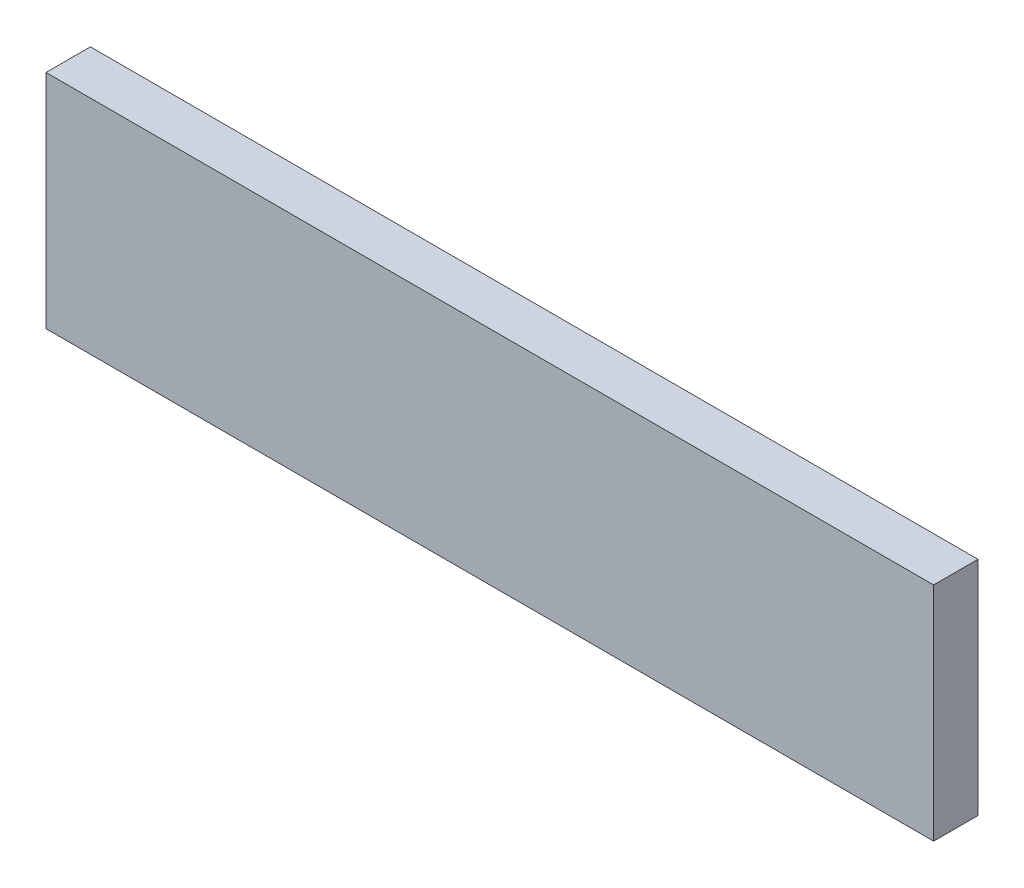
ISO-10303-21;
HEADER;
FILE_DESCRIPTION(('STEP AP214'),'2;1');
FILE_NAME('part.step','',(''),(''),'','','');
FILE_SCHEMA(('AUTOMOTIVE_DESIGN { 1 0 10303 214 1 1 1 1 }'));
ENDSEC;
DATA;
#1=APPLICATION_CONTEXT('core data for automotive mechanical design processes');
#2=APPLICATION_PROTOCOL_DEFINITION('international standard','automotive_design',2000,#1);
#3=PRODUCT_CONTEXT('',#1,'mechanical');
#4=PRODUCT('Part','Part','',(#3));
#5=PRODUCT_RELATED_PRODUCT_CATEGORY('part','',(#4));
#6=PRODUCT_DEFINITION_FORMATION('','',#4);
#7=PRODUCT_DEFINITION_CONTEXT('part definition',#1,'design');
#8=PRODUCT_DEFINITION('design','',#6,#7);
#9=PRODUCT_DEFINITION_SHAPE('','',#8);
#10=(LENGTH_UNIT() NAMED_UNIT(*) SI_UNIT(.MILLI.,.METRE.));
#11=(NAMED_UNIT(*) PLANE_ANGLE_UNIT() SI_UNIT($,.RADIAN.));
#12=(NAMED_UNIT(*) SI_UNIT($,.STERADIAN.) SOLID_ANGLE_UNIT());
#13=UNCERTAINTY_MEASURE_WITH_UNIT(LENGTH_MEASURE(1.E-05),#10,'distance_accuracy_value','');
#14=(GEOMETRIC_REPRESENTATION_CONTEXT(3) GLOBAL_UNCERTAINTY_ASSIGNED_CONTEXT((#13)) GLOBAL_UNIT_ASSIGNED_CONTEXT((#10,
#11,#12)) REPRESENTATION_CONTEXT('',''));
#15=CARTESIAN_POINT('',(0.,0.,0.));
#16=DIRECTION('',(0.,0.,1.));
#17=DIRECTION('',(1.,0.,0.));
#18=AXIS2_PLACEMENT_3D('',#15,#16,#17);
#19=CARTESIAN_POINT('',(0.,0.,10.));
#20=DIRECTION('',(1.,0.,0.));
#21=DIRECTION('',(0.,0.,-1.));
#22=AXIS2_PLACEMENT_3D('',#19,#20,#21);
#23=PLANE('',#22);
#24=DIRECTION('',(0.,-1.,0.));
#25=VECTOR('',#24,1.);
#26=CARTESIAN_POINT('',(0.,0.,0.));
#27=LINE('',#26,#25);
#28=CARTESIAN_POINT('',(0.,50.,0.));
#29=VERTEX_POINT('',#28);
#30=CARTESIAN_POINT('',(0.,0.,0.));
#31=VERTEX_POINT('',#30);
#32=EDGE_CURVE('E75',#29,#31,#27,.T.);
#33=ORIENTED_EDGE('',*,*,#32,.T.);
#34=DIRECTION('',(0.,0.,-1.));
#35=VECTOR('',#34,1.);
#36=CARTESIAN_POINT('',(0.,0.,10.));
#37=LINE('',#36,#35);
#38=CARTESIAN_POINT('',(0.,0.,10.));
#39=VERTEX_POINT('',#38);
#40=EDGE_CURVE('E11',#39,#31,#37,.T.);
#41=ORIENTED_EDGE('',*,*,#40,.F.);
#42=DIRECTION('',(0.,-1.,0.));
#43=VECTOR('',#42,1.);
#44=CARTESIAN_POINT('',(0.,0.,10.));
#45=LINE('',#44,#43);
#46=CARTESIAN_POINT('',(0.,50.,10.));
#47=VERTEX_POINT('',#46);
#48=EDGE_CURVE('E93',#47,#39,#45,.T.);
#49=ORIENTED_EDGE('',*,*,#48,.F.);
#50=DIRECTION('',(0.,0.,-1.));
#51=VECTOR('',#50,1.);
#52=CARTESIAN_POINT('',(0.,50.,10.));
#53=LINE('',#52,#51);
#54=EDGE_CURVE('E87',#47,#29,#53,.T.);
#55=ORIENTED_EDGE('',*,*,#54,.T.);
#56=EDGE_LOOP('',(#33,#41,#49,#55));
#57=FACE_BOUND('',#56,.T.);
#58=ADVANCED_FACE('F31',(#57),#23,.F.);
#59=CARTESIAN_POINT('',(0.,0.,10.));
#60=DIRECTION('',(0.,1.,0.));
#61=DIRECTION('',(0.,0.,1.));
#62=AXIS2_PLACEMENT_3D('',#59,#60,#61);
#63=PLANE('',#62);
#64=DIRECTION('',(1.,0.,0.));
#65=VECTOR('',#64,1.);
#66=CARTESIAN_POINT('',(0.,0.,0.));
#67=LINE('',#66,#65);
#68=CARTESIAN_POINT('',(200.,0.,0.));
#69=VERTEX_POINT('',#68);
#70=EDGE_CURVE('E71',#31,#69,#67,.T.);
#71=ORIENTED_EDGE('',*,*,#70,.T.);
#72=DIRECTION('',(0.,0.,-1.));
#73=VECTOR('',#72,1.);
#74=CARTESIAN_POINT('',(200.,0.,10.));
#75=LINE('',#74,#73);
#76=CARTESIAN_POINT('',(200.,0.,10.));
#77=VERTEX_POINT('',#76);
#78=EDGE_CURVE('E38',#77,#69,#75,.T.);
#79=ORIENTED_EDGE('',*,*,#78,.F.);
#80=DIRECTION('',(1.,0.,0.));
#81=VECTOR('',#80,1.);
#82=CARTESIAN_POINT('',(0.,0.,10.));
#83=LINE('',#82,#81);
#84=EDGE_CURVE('E83',#39,#77,#83,.T.);
#85=ORIENTED_EDGE('',*,*,#84,.F.);
#86=ORIENTED_EDGE('',*,*,#40,.T.);
#87=EDGE_LOOP('',(#71,#79,#85,#86));
#88=FACE_BOUND('',#87,.T.);
#89=ADVANCED_FACE('F82',(#88),#63,.F.);
#90=CARTESIAN_POINT('',(200.,0.,10.));
#91=DIRECTION('',(-1.,0.,0.));
#92=DIRECTION('',(0.,0.,1.));
#93=AXIS2_PLACEMENT_3D('',#90,#91,#92);
#94=PLANE('',#93);
#95=DIRECTION('',(0.,1.,0.));
#96=VECTOR('',#95,1.);
#97=CARTESIAN_POINT('',(200.,0.,0.));
#98=LINE('',#97,#96);
#99=CARTESIAN_POINT('',(200.,50.,0.));
#100=VERTEX_POINT('',#99);
#101=EDGE_CURVE('E76',#69,#100,#98,.T.);
#102=ORIENTED_EDGE('',*,*,#101,.T.);
#103=DIRECTION('',(0.,0.,-1.));
#104=VECTOR('',#103,1.);
#105=CARTESIAN_POINT('',(200.,50.,10.));
#106=LINE('',#105,#104);
#107=CARTESIAN_POINT('',(200.,50.,10.));
#108=VERTEX_POINT('',#107);
#109=EDGE_CURVE('E99',#108,#100,#106,.T.);
#110=ORIENTED_EDGE('',*,*,#109,.F.);
#111=DIRECTION('',(0.,1.,0.));
#112=VECTOR('',#111,1.);
#113=CARTESIAN_POINT('',(200.,0.,10.));
#114=LINE('',#113,#112);
#115=EDGE_CURVE('E50',#77,#108,#114,.T.);
#116=ORIENTED_EDGE('',*,*,#115,.F.);
#117=ORIENTED_EDGE('',*,*,#78,.T.);
#118=EDGE_LOOP('',(#102,#110,#116,#117));
#119=FACE_BOUND('',#118,.T.);
#120=ADVANCED_FACE('F102',(#119),#94,.F.);
#121=CARTESIAN_POINT('',(0.,50.,10.));
#122=DIRECTION('',(0.,-1.,0.));
#123=DIRECTION('',(0.,0.,-1.));
#124=AXIS2_PLACEMENT_3D('',#121,#122,#123);
#125=PLANE('',#124);
#126=DIRECTION('',(-1.,0.,0.));
#127=VECTOR('',#126,1.);
#128=CARTESIAN_POINT('',(0.,50.,0.));
#129=LINE('',#128,#127);
#130=EDGE_CURVE('E91',#100,#29,#129,.T.);
#131=ORIENTED_EDGE('',*,*,#130,.T.);
#132=ORIENTED_EDGE('',*,*,#54,.F.);
#133=DIRECTION('',(-1.,0.,0.));
#134=VECTOR('',#133,1.);
#135=CARTESIAN_POINT('',(0.,50.,10.));
#136=LINE('',#135,#134);
#137=EDGE_CURVE('E45',#108,#47,#136,.T.);
#138=ORIENTED_EDGE('',*,*,#137,.F.);
#139=ORIENTED_EDGE('',*,*,#109,.T.);
#140=EDGE_LOOP('',(#131,#132,#138,#139));
#141=FACE_BOUND('',#140,.T.);
#142=ADVANCED_FACE('F104',(#141),#125,.F.);
#143=CARTESIAN_POINT('',(0.,50.,10.));
#144=DIRECTION('',(0.,0.,-1.));
#145=DIRECTION('',(-1.,0.,0.));
#146=AXIS2_PLACEMENT_3D('',#143,#144,#145);
#147=PLANE('',#146);
#148=ORIENTED_EDGE('',*,*,#48,.T.);
#149=ORIENTED_EDGE('',*,*,#84,.T.);
#150=ORIENTED_EDGE('',*,*,#115,.T.);
#151=ORIENTED_EDGE('',*,*,#137,.T.);
#152=EDGE_LOOP('',(#148,#149,#150,#151));
#153=FACE_BOUND('',#152,.T.);
#154=ADVANCED_FACE('F105',(#153),#147,.F.);
#155=CARTESIAN_POINT('',(0.,50.,0.));
#156=DIRECTION('',(0.,0.,-1.));
#157=DIRECTION('',(-1.,0.,0.));
#158=AXIS2_PLACEMENT_3D('',#155,#156,#157);
#159=PLANE('',#158);
#160=ORIENTED_EDGE('',*,*,#32,.F.);
#161=ORIENTED_EDGE('',*,*,#130,.F.);
#162=ORIENTED_EDGE('',*,*,#101,.F.);
#163=ORIENTED_EDGE('',*,*,#70,.F.);
#164=EDGE_LOOP('',(#160,#161,#162,#163));
#165=FACE_BOUND('',#164,.T.);
#166=ADVANCED_FACE('F72',(#165),#159,.T.);
#167=CLOSED_SHELL('',(#58,#89,#120,#142,#154,#166));
#168=MANIFOLD_SOLID_BREP('B2',#167);
#169=ADVANCED_BREP_SHAPE_REPRESENTATION('',(#18,#168),#14);
#170=SHAPE_DEFINITION_REPRESENTATION(#9,#169);
ENDSEC;
END-ISO-10303-21;
